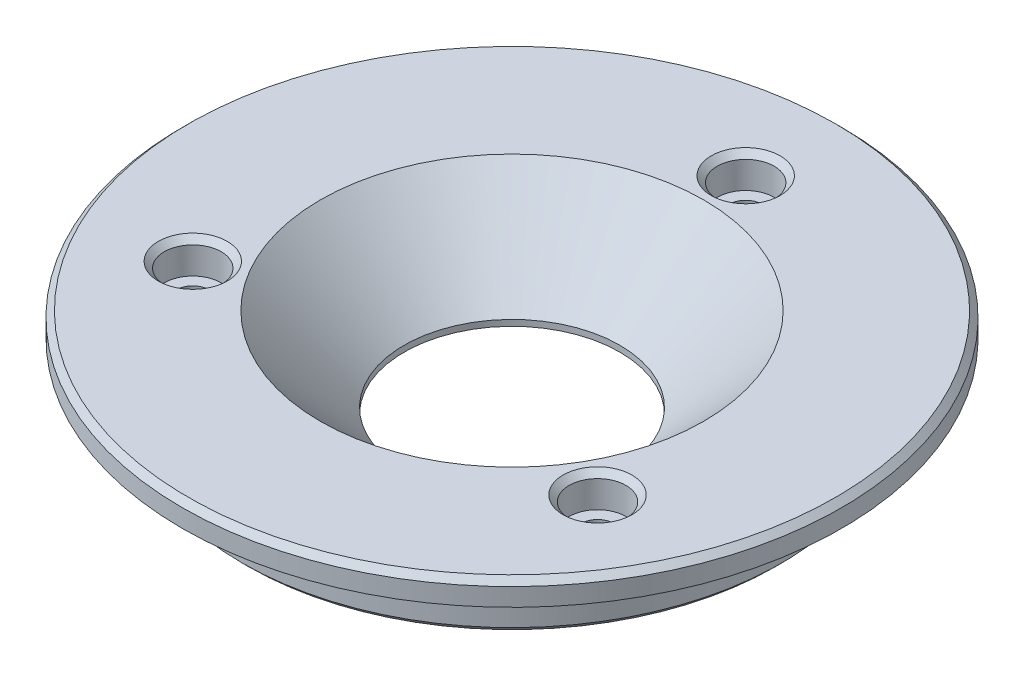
ISO-10303-21;
HEADER;
FILE_DESCRIPTION(('STEP AP214'),'2;1');
FILE_NAME('part.step','',(''),(''),'','','');
FILE_SCHEMA(('AUTOMOTIVE_DESIGN { 1 0 10303 214 1 1 1 1 }'));
ENDSEC;
DATA;
#1=APPLICATION_CONTEXT('core data for automotive mechanical design processes');
#2=APPLICATION_PROTOCOL_DEFINITION('international standard','automotive_design',2000,#1);
#3=PRODUCT_CONTEXT('',#1,'mechanical');
#4=PRODUCT('Part','Part','',(#3));
#5=PRODUCT_RELATED_PRODUCT_CATEGORY('part','',(#4));
#6=PRODUCT_DEFINITION_FORMATION('','',#4);
#7=PRODUCT_DEFINITION_CONTEXT('part definition',#1,'design');
#8=PRODUCT_DEFINITION('design','',#6,#7);
#9=PRODUCT_DEFINITION_SHAPE('','',#8);
#10=(LENGTH_UNIT() NAMED_UNIT(*) SI_UNIT(.MILLI.,.METRE.));
#11=(NAMED_UNIT(*) PLANE_ANGLE_UNIT() SI_UNIT($,.RADIAN.));
#12=(NAMED_UNIT(*) SI_UNIT($,.STERADIAN.) SOLID_ANGLE_UNIT());
#13=UNCERTAINTY_MEASURE_WITH_UNIT(LENGTH_MEASURE(1.E-05),#10,'distance_accuracy_value','');
#14=(GEOMETRIC_REPRESENTATION_CONTEXT(3) GLOBAL_UNCERTAINTY_ASSIGNED_CONTEXT((#13)) GLOBAL_UNIT_ASSIGNED_CONTEXT((#10,
#11,#12)) REPRESENTATION_CONTEXT('',''));
#15=CARTESIAN_POINT('',(0.,0.,0.));
#16=DIRECTION('',(0.,0.,1.));
#17=DIRECTION('',(1.,0.,0.));
#18=AXIS2_PLACEMENT_3D('',#15,#16,#17);
#19=CARTESIAN_POINT('',(-32.,15.,0.));
#20=DIRECTION('',(0.,-1.,0.));
#21=DIRECTION('',(0.,0.,-1.));
#22=AXIS2_PLACEMENT_3D('',#19,#20,#21);
#23=PLANE('',#22);
#24=CARTESIAN_POINT('',(33.7749907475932,15.,19.5));
#25=DIRECTION('',(0.,-1.,0.));
#26=DIRECTION('',(0.,0.,-1.));
#27=AXIS2_PLACEMENT_3D('',#24,#25,#26);
#28=CIRCLE('',#27,5.75);
#29=CARTESIAN_POINT('',(33.7749907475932,15.,13.75));
#30=VERTEX_POINT('',#29);
#31=EDGE_CURVE('E25',#30,#30,#28,.T.);
#32=ORIENTED_EDGE('',*,*,#31,.T.);
#33=EDGE_LOOP('',(#32));
#34=FACE_BOUND('',#33,.T.);
#35=CARTESIAN_POINT('',(0.,15.,-39.));
#36=DIRECTION('',(0.,-1.,0.));
#37=DIRECTION('',(0.,0.,-1.));
#38=AXIS2_PLACEMENT_3D('',#35,#36,#37);
#39=CIRCLE('',#38,5.75);
#40=CARTESIAN_POINT('',(0.,15.,-44.75));
#41=VERTEX_POINT('',#40);
#42=EDGE_CURVE('E29',#41,#41,#39,.T.);
#43=ORIENTED_EDGE('',*,*,#42,.T.);
#44=EDGE_LOOP('',(#43));
#45=FACE_BOUND('',#44,.T.);
#46=CARTESIAN_POINT('',(-33.7749907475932,15.,19.5));
#47=DIRECTION('',(0.,-1.,0.));
#48=DIRECTION('',(0.,0.,-1.));
#49=AXIS2_PLACEMENT_3D('',#46,#47,#48);
#50=CIRCLE('',#49,5.75);
#51=CARTESIAN_POINT('',(-33.7749907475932,15.,13.75));
#52=VERTEX_POINT('',#51);
#53=EDGE_CURVE('E34',#52,#52,#50,.T.);
#54=ORIENTED_EDGE('',*,*,#53,.T.);
#55=EDGE_LOOP('',(#54));
#56=FACE_BOUND('',#55,.T.);
#57=CARTESIAN_POINT('',(0.,15.,0.));
#58=DIRECTION('',(0.,-1.,0.));
#59=DIRECTION('',(0.,0.,-1.));
#60=AXIS2_PLACEMENT_3D('',#57,#58,#59);
#61=CIRCLE('',#60,54.);
#62=CARTESIAN_POINT('',(0.,15.,-54.));
#63=VERTEX_POINT('',#62);
#64=EDGE_CURVE('E58',#63,#63,#61,.F.);
#65=ORIENTED_EDGE('',*,*,#64,.T.);
#66=EDGE_LOOP('',(#65));
#67=FACE_BOUND('',#66,.T.);
#68=CARTESIAN_POINT('',(0.,15.,0.));
#69=DIRECTION('',(0.,-1.,0.));
#70=DIRECTION('',(0.,0.,-1.));
#71=AXIS2_PLACEMENT_3D('',#68,#69,#70);
#72=CIRCLE('',#71,32.);
#73=CARTESIAN_POINT('',(0.,15.,-32.));
#74=VERTEX_POINT('',#73);
#75=EDGE_CURVE('E70',#74,#74,#72,.T.);
#76=ORIENTED_EDGE('',*,*,#75,.T.);
#77=EDGE_LOOP('',(#76));
#78=FACE_BOUND('',#77,.T.);
#79=ADVANCED_FACE('F14',(#34,#45,#56,#67,#78),#23,.F.);
#80=CARTESIAN_POINT('',(0.,1.,0.));
#81=DIRECTION('',(0.,1.,0.));
#82=DIRECTION('',(0.,0.,1.));
#83=AXIS2_PLACEMENT_3D('',#80,#81,#82);
#84=CONICAL_SURFACE('',#83,18.,0.78539816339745);
#85=ORIENTED_EDGE('',*,*,#75,.F.);
#86=EDGE_LOOP('',(#85));
#87=FACE_BOUND('',#86,.T.);
#88=CARTESIAN_POINT('',(0.,1.,0.));
#89=DIRECTION('',(0.,-1.,0.));
#90=DIRECTION('',(0.,0.,-1.));
#91=AXIS2_PLACEMENT_3D('',#88,#89,#90);
#92=CIRCLE('',#91,18.);
#93=CARTESIAN_POINT('',(0.,1.,-18.));
#94=VERTEX_POINT('',#93);
#95=EDGE_CURVE('E83',#94,#94,#92,.T.);
#96=ORIENTED_EDGE('',*,*,#95,.T.);
#97=EDGE_LOOP('',(#96));
#98=FACE_BOUND('',#97,.T.);
#99=ADVANCED_FACE('F123',(#87,#98),#84,.F.);
#100=CARTESIAN_POINT('',(0.,0.,0.));
#101=DIRECTION('',(0.,-1.,0.));
#102=DIRECTION('',(0.,0.,-1.));
#103=AXIS2_PLACEMENT_3D('',#100,#101,#102);
#104=CYLINDRICAL_SURFACE('',#103,18.);
#105=ORIENTED_EDGE('',*,*,#95,.F.);
#106=EDGE_LOOP('',(#105));
#107=FACE_BOUND('',#106,.T.);
#108=CARTESIAN_POINT('',(0.,0.,0.));
#109=DIRECTION('',(0.,-1.,0.));
#110=DIRECTION('',(0.,0.,-1.));
#111=AXIS2_PLACEMENT_3D('',#108,#109,#110);
#112=CIRCLE('',#111,18.);
#113=CARTESIAN_POINT('',(0.,0.,-18.));
#114=VERTEX_POINT('',#113);
#115=EDGE_CURVE('E86',#114,#114,#112,.T.);
#116=ORIENTED_EDGE('',*,*,#115,.T.);
#117=EDGE_LOOP('',(#116));
#118=FACE_BOUND('',#117,.T.);
#119=ADVANCED_FACE('F130',(#107,#118),#104,.F.);
#120=CARTESIAN_POINT('',(-18.,0.,0.));
#121=DIRECTION('',(0.,1.,0.));
#122=DIRECTION('',(0.,0.,1.));
#123=AXIS2_PLACEMENT_3D('',#120,#121,#122);
#124=PLANE('',#123);
#125=CARTESIAN_POINT('',(-33.7749907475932,0.,19.5));
#126=DIRECTION('',(0.,1.,0.));
#127=DIRECTION('',(0.,0.,1.));
#128=AXIS2_PLACEMENT_3D('',#125,#126,#127);
#129=CIRCLE('',#128,3.7499999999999);
#130=CARTESIAN_POINT('',(-33.7749907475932,0.,23.2499999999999));
#131=VERTEX_POINT('',#130);
#132=EDGE_CURVE('E49',#131,#131,#129,.T.);
#133=ORIENTED_EDGE('',*,*,#132,.T.);
#134=EDGE_LOOP('',(#133));
#135=FACE_BOUND('',#134,.T.);
#136=CARTESIAN_POINT('',(33.7749907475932,0.,19.5));
#137=DIRECTION('',(0.,1.,0.));
#138=DIRECTION('',(0.,0.,1.));
#139=AXIS2_PLACEMENT_3D('',#136,#137,#138);
#140=CIRCLE('',#139,3.74999999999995);
#141=CARTESIAN_POINT('',(33.7749907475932,0.,23.25));
#142=VERTEX_POINT('',#141);
#143=EDGE_CURVE('E52',#142,#142,#140,.T.);
#144=ORIENTED_EDGE('',*,*,#143,.T.);
#145=EDGE_LOOP('',(#144));
#146=FACE_BOUND('',#145,.T.);
#147=CARTESIAN_POINT('',(0.,0.,-39.));
#148=DIRECTION('',(0.,1.,0.));
#149=DIRECTION('',(0.,0.,1.));
#150=AXIS2_PLACEMENT_3D('',#147,#148,#149);
#151=CIRCLE('',#150,3.74999999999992);
#152=CARTESIAN_POINT('',(0.,0.,-35.2500000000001));
#153=VERTEX_POINT('',#152);
#154=EDGE_CURVE('E55',#153,#153,#151,.T.);
#155=ORIENTED_EDGE('',*,*,#154,.T.);
#156=EDGE_LOOP('',(#155));
#157=FACE_BOUND('',#156,.T.);
#158=CARTESIAN_POINT('',(0.,0.,0.));
#159=DIRECTION('',(0.,1.,0.));
#160=DIRECTION('',(0.,0.,1.));
#161=AXIS2_PLACEMENT_3D('',#158,#159,#160);
#162=CIRCLE('',#161,44.);
#163=CARTESIAN_POINT('',(0.,0.,44.));
#164=VERTEX_POINT('',#163);
#165=EDGE_CURVE('E67',#164,#164,#162,.F.);
#166=ORIENTED_EDGE('',*,*,#165,.T.);
#167=EDGE_LOOP('',(#166));
#168=FACE_BOUND('',#167,.T.);
#169=ORIENTED_EDGE('',*,*,#115,.F.);
#170=EDGE_LOOP('',(#169));
#171=FACE_BOUND('',#170,.T.);
#172=ADVANCED_FACE('F181',(#135,#146,#157,#168,#171),#124,.F.);
#173=CARTESIAN_POINT('',(0.,0.,0.));
#174=DIRECTION('',(0.,-1.,0.));
#175=DIRECTION('',(0.,0.,-1.));
#176=AXIS2_PLACEMENT_3D('',#173,#174,#175);
#177=CYLINDRICAL_SURFACE('',#176,45.);
#178=CARTESIAN_POINT('',(0.,0.999999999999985,0.));
#179=DIRECTION('',(0.,1.,0.));
#180=DIRECTION('',(0.,0.,1.));
#181=AXIS2_PLACEMENT_3D('',#178,#179,#180);
#182=CIRCLE('',#181,45.);
#183=CARTESIAN_POINT('',(0.,0.999999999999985,45.));
#184=VERTEX_POINT('',#183);
#185=EDGE_CURVE('E64',#184,#184,#182,.T.);
#186=ORIENTED_EDGE('',*,*,#185,.T.);
#187=EDGE_LOOP('',(#186));
#188=FACE_BOUND('',#187,.T.);
#189=CARTESIAN_POINT('',(0.,11.,0.));
#190=DIRECTION('',(0.,-1.,0.));
#191=DIRECTION('',(0.,0.,-1.));
#192=AXIS2_PLACEMENT_3D('',#189,#190,#191);
#193=CIRCLE('',#192,45.);
#194=CARTESIAN_POINT('',(0.,11.,-45.));
#195=VERTEX_POINT('',#194);
#196=EDGE_CURVE('E89',#195,#195,#193,.T.);
#197=ORIENTED_EDGE('',*,*,#196,.T.);
#198=EDGE_LOOP('',(#197));
#199=FACE_BOUND('',#198,.T.);
#200=ADVANCED_FACE('F185',(#188,#199),#177,.T.);
#201=CARTESIAN_POINT('',(-45.,11.,0.));
#202=DIRECTION('',(0.,1.,0.));
#203=DIRECTION('',(0.,0.,1.));
#204=AXIS2_PLACEMENT_3D('',#201,#202,#203);
#205=PLANE('',#204);
#206=ORIENTED_EDGE('',*,*,#196,.F.);
#207=EDGE_LOOP('',(#206));
#208=FACE_BOUND('',#207,.T.);
#209=CARTESIAN_POINT('',(0.,11.,0.));
#210=DIRECTION('',(0.,-1.,0.));
#211=DIRECTION('',(0.,0.,-1.));
#212=AXIS2_PLACEMENT_3D('',#209,#210,#211);
#213=CIRCLE('',#212,55.);
#214=CARTESIAN_POINT('',(0.,11.,-55.));
#215=VERTEX_POINT('',#214);
#216=EDGE_CURVE('E92',#215,#215,#213,.T.);
#217=ORIENTED_EDGE('',*,*,#216,.T.);
#218=EDGE_LOOP('',(#217));
#219=FACE_BOUND('',#218,.T.);
#220=ADVANCED_FACE('F192',(#208,#219),#205,.F.);
#221=CARTESIAN_POINT('',(0.,0.,0.));
#222=DIRECTION('',(0.,-1.,0.));
#223=DIRECTION('',(0.,0.,-1.));
#224=AXIS2_PLACEMENT_3D('',#221,#222,#223);
#225=CYLINDRICAL_SURFACE('',#224,55.);
#226=CARTESIAN_POINT('',(0.,14.,0.));
#227=DIRECTION('',(0.,-1.,0.));
#228=DIRECTION('',(0.,0.,-1.));
#229=AXIS2_PLACEMENT_3D('',#226,#227,#228);
#230=CIRCLE('',#229,55.);
#231=CARTESIAN_POINT('',(0.,14.,-55.));
#232=VERTEX_POINT('',#231);
#233=EDGE_CURVE('E61',#232,#232,#230,.T.);
#234=ORIENTED_EDGE('',*,*,#233,.T.);
#235=EDGE_LOOP('',(#234));
#236=FACE_BOUND('',#235,.T.);
#237=ORIENTED_EDGE('',*,*,#216,.F.);
#238=EDGE_LOOP('',(#237));
#239=FACE_BOUND('',#238,.T.);
#240=ADVANCED_FACE('F199',(#236,#239),#225,.T.);
#241=CARTESIAN_POINT('',(33.7749907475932,9.5,19.5));
#242=DIRECTION('',(0.,1.,0.));
#243=DIRECTION('',(0.,0.,1.));
#244=AXIS2_PLACEMENT_3D('',#241,#242,#243);
#245=CYLINDRICAL_SURFACE('',#244,4.75);
#246=CARTESIAN_POINT('',(33.7749907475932,14.,19.5));
#247=DIRECTION('',(0.,-1.,0.));
#248=DIRECTION('',(0.,0.,-1.));
#249=AXIS2_PLACEMENT_3D('',#246,#247,#248);
#250=CIRCLE('',#249,4.75);
#251=CARTESIAN_POINT('',(33.7749907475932,14.,14.75));
#252=VERTEX_POINT('',#251);
#253=EDGE_CURVE('E37',#252,#252,#250,.F.);
#254=ORIENTED_EDGE('',*,*,#253,.T.);
#255=EDGE_LOOP('',(#254));
#256=FACE_BOUND('',#255,.T.);
#257=CARTESIAN_POINT('',(33.7749907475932,9.5,19.5));
#258=DIRECTION('',(0.,1.,0.));
#259=DIRECTION('',(0.,0.,-1.));
#260=AXIS2_PLACEMENT_3D('',#257,#258,#259);
#261=CIRCLE('',#260,4.75);
#262=CARTESIAN_POINT('',(33.7749907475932,9.5,14.75));
#263=VERTEX_POINT('',#262);
#264=EDGE_CURVE('E74',#263,#263,#261,.T.);
#265=ORIENTED_EDGE('',*,*,#264,.F.);
#266=EDGE_LOOP('',(#265));
#267=FACE_BOUND('',#266,.T.);
#268=ADVANCED_FACE('F203',(#256,#267),#245,.F.);
#269=CARTESIAN_POINT('',(33.7749907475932,9.5,19.5));
#270=DIRECTION('',(0.,-1.,0.));
#271=DIRECTION('',(0.,0.,-1.));
#272=AXIS2_PLACEMENT_3D('',#269,#270,#271);
#273=PLANE('',#272);
#274=CARTESIAN_POINT('',(33.7749907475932,9.5,19.5));
#275=DIRECTION('',(0.,-1.,0.));
#276=DIRECTION('',(0.,0.,-1.));
#277=AXIS2_PLACEMENT_3D('',#274,#275,#276);
#278=CIRCLE('',#277,2.75);
#279=CARTESIAN_POINT('',(33.7749907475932,9.5,16.75));
#280=VERTEX_POINT('',#279);
#281=EDGE_CURVE('E71',#280,#280,#278,.T.);
#282=ORIENTED_EDGE('',*,*,#281,.T.);
#283=EDGE_LOOP('',(#282));
#284=FACE_BOUND('',#283,.T.);
#285=ORIENTED_EDGE('',*,*,#264,.T.);
#286=EDGE_LOOP('',(#285));
#287=FACE_BOUND('',#286,.T.);
#288=ADVANCED_FACE('F207',(#284,#287),#273,.F.);
#289=CARTESIAN_POINT('',(-33.7749907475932,9.5,19.5));
#290=DIRECTION('',(0.,1.,0.));
#291=DIRECTION('',(0.,0.,1.));
#292=AXIS2_PLACEMENT_3D('',#289,#290,#291);
#293=CYLINDRICAL_SURFACE('',#292,4.75);
#294=CARTESIAN_POINT('',(-33.7749907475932,14.,19.5));
#295=DIRECTION('',(0.,-1.,0.));
#296=DIRECTION('',(0.,0.,-1.));
#297=AXIS2_PLACEMENT_3D('',#294,#295,#296);
#298=CIRCLE('',#297,4.75);
#299=CARTESIAN_POINT('',(-33.7749907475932,14.,14.75));
#300=VERTEX_POINT('',#299);
#301=EDGE_CURVE('E9',#300,#300,#298,.F.);
#302=ORIENTED_EDGE('',*,*,#301,.T.);
#303=EDGE_LOOP('',(#302));
#304=FACE_BOUND('',#303,.T.);
#305=CARTESIAN_POINT('',(-33.7749907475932,9.5,19.5));
#306=DIRECTION('',(0.,1.,0.));
#307=DIRECTION('',(0.,0.,1.));
#308=AXIS2_PLACEMENT_3D('',#305,#306,#307);
#309=CIRCLE('',#308,4.75);
#310=CARTESIAN_POINT('',(-33.7749907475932,9.5,24.25));
#311=VERTEX_POINT('',#310);
#312=EDGE_CURVE('E98',#311,#311,#309,.T.);
#313=ORIENTED_EDGE('',*,*,#312,.F.);
#314=EDGE_LOOP('',(#313));
#315=FACE_BOUND('',#314,.T.);
#316=ADVANCED_FACE('F119',(#304,#315),#293,.F.);
#317=CARTESIAN_POINT('',(-33.7749907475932,9.5,19.5));
#318=DIRECTION('',(0.,1.,0.));
#319=DIRECTION('',(0.,0.,1.));
#320=AXIS2_PLACEMENT_3D('',#317,#318,#319);
#321=PLANE('',#320);
#322=CARTESIAN_POINT('',(-33.7749907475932,9.5,19.5));
#323=DIRECTION('',(0.,1.,0.));
#324=DIRECTION('',(0.,0.,1.));
#325=AXIS2_PLACEMENT_3D('',#322,#323,#324);
#326=CIRCLE('',#325,2.75);
#327=CARTESIAN_POINT('',(-33.7749907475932,9.5,22.25));
#328=VERTEX_POINT('',#327);
#329=EDGE_CURVE('E75',#328,#328,#326,.T.);
#330=ORIENTED_EDGE('',*,*,#329,.F.);
#331=EDGE_LOOP('',(#330));
#332=FACE_BOUND('',#331,.T.);
#333=ORIENTED_EDGE('',*,*,#312,.T.);
#334=EDGE_LOOP('',(#333));
#335=FACE_BOUND('',#334,.T.);
#336=ADVANCED_FACE('F108',(#332,#335),#321,.T.);
#337=CARTESIAN_POINT('',(0.,9.5,-39.));
#338=DIRECTION('',(0.,1.,0.));
#339=DIRECTION('',(0.,0.,1.));
#340=AXIS2_PLACEMENT_3D('',#337,#338,#339);
#341=CYLINDRICAL_SURFACE('',#340,4.75);
#342=CARTESIAN_POINT('',(0.,14.,-39.));
#343=DIRECTION('',(0.,-1.,0.));
#344=DIRECTION('',(0.,0.,-1.));
#345=AXIS2_PLACEMENT_3D('',#342,#343,#344);
#346=CIRCLE('',#345,4.75);
#347=CARTESIAN_POINT('',(0.,14.,-43.75));
#348=VERTEX_POINT('',#347);
#349=EDGE_CURVE('E21',#348,#348,#346,.F.);
#350=ORIENTED_EDGE('',*,*,#349,.T.);
#351=EDGE_LOOP('',(#350));
#352=FACE_BOUND('',#351,.T.);
#353=CARTESIAN_POINT('',(0.,9.5,-39.));
#354=DIRECTION('',(0.,1.,0.));
#355=DIRECTION('',(0.,0.,1.));
#356=AXIS2_PLACEMENT_3D('',#353,#354,#355);
#357=CIRCLE('',#356,4.75);
#358=CARTESIAN_POINT('',(0.,9.5,-34.25));
#359=VERTEX_POINT('',#358);
#360=EDGE_CURVE('E95',#359,#359,#357,.T.);
#361=ORIENTED_EDGE('',*,*,#360,.F.);
#362=EDGE_LOOP('',(#361));
#363=FACE_BOUND('',#362,.T.);
#364=ADVANCED_FACE('F106',(#352,#363),#341,.F.);
#365=CARTESIAN_POINT('',(0.,9.5,-39.));
#366=DIRECTION('',(0.,1.,0.));
#367=DIRECTION('',(0.,0.,1.));
#368=AXIS2_PLACEMENT_3D('',#365,#366,#367);
#369=PLANE('',#368);
#370=CARTESIAN_POINT('',(0.,9.5,-39.));
#371=DIRECTION('',(0.,1.,0.));
#372=DIRECTION('',(0.,0.,1.));
#373=AXIS2_PLACEMENT_3D('',#370,#371,#372);
#374=CIRCLE('',#373,2.75);
#375=CARTESIAN_POINT('',(0.,9.5,-36.25));
#376=VERTEX_POINT('',#375);
#377=EDGE_CURVE('E78',#376,#376,#374,.T.);
#378=ORIENTED_EDGE('',*,*,#377,.F.);
#379=EDGE_LOOP('',(#378));
#380=FACE_BOUND('',#379,.T.);
#381=ORIENTED_EDGE('',*,*,#360,.T.);
#382=EDGE_LOOP('',(#381));
#383=FACE_BOUND('',#382,.T.);
#384=ADVANCED_FACE('F104',(#380,#383),#369,.T.);
#385=CARTESIAN_POINT('',(0.,0.,-39.));
#386=DIRECTION('',(0.,1.,0.));
#387=DIRECTION('',(0.,0.,1.));
#388=AXIS2_PLACEMENT_3D('',#385,#386,#387);
#389=CYLINDRICAL_SURFACE('',#388,2.75);
#390=CARTESIAN_POINT('',(0.,0.999999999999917,-39.));
#391=DIRECTION('',(0.,1.,0.));
#392=DIRECTION('',(0.,0.,1.));
#393=AXIS2_PLACEMENT_3D('',#390,#391,#392);
#394=CIRCLE('',#393,2.75);
#395=CARTESIAN_POINT('',(0.,0.999999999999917,-36.25));
#396=VERTEX_POINT('',#395);
#397=EDGE_CURVE('E40',#396,#396,#394,.F.);
#398=ORIENTED_EDGE('',*,*,#397,.T.);
#399=EDGE_LOOP('',(#398));
#400=FACE_BOUND('',#399,.T.);
#401=ORIENTED_EDGE('',*,*,#377,.T.);
#402=EDGE_LOOP('',(#401));
#403=FACE_BOUND('',#402,.T.);
#404=ADVANCED_FACE('F116',(#400,#403),#389,.F.);
#405=CARTESIAN_POINT('',(-33.7749907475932,0.,19.5));
#406=DIRECTION('',(0.,1.,0.));
#407=DIRECTION('',(0.,0.,1.));
#408=AXIS2_PLACEMENT_3D('',#405,#406,#407);
#409=CYLINDRICAL_SURFACE('',#408,2.75);
#410=CARTESIAN_POINT('',(-33.7749907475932,0.999999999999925,19.5));
#411=DIRECTION('',(0.,1.,0.));
#412=DIRECTION('',(0.,0.,1.));
#413=AXIS2_PLACEMENT_3D('',#410,#411,#412);
#414=CIRCLE('',#413,2.75);
#415=CARTESIAN_POINT('',(-33.7749907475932,0.999999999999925,22.25));
#416=VERTEX_POINT('',#415);
#417=EDGE_CURVE('E46',#416,#416,#414,.F.);
#418=ORIENTED_EDGE('',*,*,#417,.T.);
#419=EDGE_LOOP('',(#418));
#420=FACE_BOUND('',#419,.T.);
#421=ORIENTED_EDGE('',*,*,#329,.T.);
#422=EDGE_LOOP('',(#421));
#423=FACE_BOUND('',#422,.T.);
#424=ADVANCED_FACE('F338',(#420,#423),#409,.F.);
#425=CARTESIAN_POINT('',(33.7749907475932,0.,19.5));
#426=DIRECTION('',(0.,1.,0.));
#427=DIRECTION('',(0.,0.,1.));
#428=AXIS2_PLACEMENT_3D('',#425,#426,#427);
#429=CYLINDRICAL_SURFACE('',#428,2.75);
#430=CARTESIAN_POINT('',(33.7749907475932,0.999999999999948,19.5));
#431=DIRECTION('',(0.,1.,0.));
#432=DIRECTION('',(0.,0.,1.));
#433=AXIS2_PLACEMENT_3D('',#430,#431,#432);
#434=CIRCLE('',#433,2.75);
#435=CARTESIAN_POINT('',(33.7749907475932,0.999999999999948,22.25));
#436=VERTEX_POINT('',#435);
#437=EDGE_CURVE('E43',#436,#436,#434,.F.);
#438=ORIENTED_EDGE('',*,*,#437,.T.);
#439=EDGE_LOOP('',(#438));
#440=FACE_BOUND('',#439,.T.);
#441=ORIENTED_EDGE('',*,*,#281,.F.);
#442=EDGE_LOOP('',(#441));
#443=FACE_BOUND('',#442,.T.);
#444=ADVANCED_FACE('F140',(#440,#443),#429,.F.);
#445=CARTESIAN_POINT('',(0.,0.,0.));
#446=DIRECTION('',(0.,1.,0.));
#447=DIRECTION('',(0.,0.,1.));
#448=AXIS2_PLACEMENT_3D('',#445,#446,#447);
#449=CONICAL_SURFACE('',#448,44.,0.785398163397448);
#450=ORIENTED_EDGE('',*,*,#185,.F.);
#451=EDGE_LOOP('',(#450));
#452=FACE_BOUND('',#451,.T.);
#453=ORIENTED_EDGE('',*,*,#165,.F.);
#454=EDGE_LOOP('',(#453));
#455=FACE_BOUND('',#454,.T.);
#456=ADVANCED_FACE('F136',(#452,#455),#449,.T.);
#457=CARTESIAN_POINT('',(0.,14.,0.));
#458=DIRECTION('',(0.,-1.,0.));
#459=DIRECTION('',(0.,0.,-1.));
#460=AXIS2_PLACEMENT_3D('',#457,#458,#459);
#461=CONICAL_SURFACE('',#460,55.,0.785398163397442);
#462=ORIENTED_EDGE('',*,*,#64,.F.);
#463=EDGE_LOOP('',(#462));
#464=FACE_BOUND('',#463,.T.);
#465=ORIENTED_EDGE('',*,*,#233,.F.);
#466=EDGE_LOOP('',(#465));
#467=FACE_BOUND('',#466,.T.);
#468=ADVANCED_FACE('F139',(#464,#467),#461,.T.);
#469=CARTESIAN_POINT('',(-33.7749907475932,0.,19.5));
#470=DIRECTION('',(0.,-1.,0.));
#471=DIRECTION('',(0.,0.,-1.));
#472=AXIS2_PLACEMENT_3D('',#469,#470,#471);
#473=CONICAL_SURFACE('',#472,3.7499999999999,0.785398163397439);
#474=ORIENTED_EDGE('',*,*,#417,.F.);
#475=EDGE_LOOP('',(#474));
#476=FACE_BOUND('',#475,.T.);
#477=ORIENTED_EDGE('',*,*,#132,.F.);
#478=EDGE_LOOP('',(#477));
#479=FACE_BOUND('',#478,.T.);
#480=ADVANCED_FACE('F144',(#476,#479),#473,.F.);
#481=CARTESIAN_POINT('',(33.7749907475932,0.,19.5));
#482=DIRECTION('',(0.,-1.,0.));
#483=DIRECTION('',(0.,0.,-1.));
#484=AXIS2_PLACEMENT_3D('',#481,#482,#483);
#485=CONICAL_SURFACE('',#484,3.74999999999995,0.785398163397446);
#486=ORIENTED_EDGE('',*,*,#437,.F.);
#487=EDGE_LOOP('',(#486));
#488=FACE_BOUND('',#487,.T.);
#489=ORIENTED_EDGE('',*,*,#143,.F.);
#490=EDGE_LOOP('',(#489));
#491=FACE_BOUND('',#490,.T.);
#492=ADVANCED_FACE('F148',(#488,#491),#485,.F.);
#493=CARTESIAN_POINT('',(0.,0.,-39.));
#494=DIRECTION('',(0.,-1.,0.));
#495=DIRECTION('',(0.,0.,-1.));
#496=AXIS2_PLACEMENT_3D('',#493,#494,#495);
#497=CONICAL_SURFACE('',#496,3.74999999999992,0.785398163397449);
#498=ORIENTED_EDGE('',*,*,#397,.F.);
#499=EDGE_LOOP('',(#498));
#500=FACE_BOUND('',#499,.T.);
#501=ORIENTED_EDGE('',*,*,#154,.F.);
#502=EDGE_LOOP('',(#501));
#503=FACE_BOUND('',#502,.T.);
#504=ADVANCED_FACE('F152',(#500,#503),#497,.F.);
#505=CARTESIAN_POINT('',(33.7749907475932,14.,19.5));
#506=DIRECTION('',(0.,1.,0.));
#507=DIRECTION('',(0.,0.,1.));
#508=AXIS2_PLACEMENT_3D('',#505,#506,#507);
#509=CONICAL_SURFACE('',#508,4.75,0.785398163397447);
#510=ORIENTED_EDGE('',*,*,#31,.F.);
#511=EDGE_LOOP('',(#510));
#512=FACE_BOUND('',#511,.T.);
#513=ORIENTED_EDGE('',*,*,#253,.F.);
#514=EDGE_LOOP('',(#513));
#515=FACE_BOUND('',#514,.T.);
#516=ADVANCED_FACE('F156',(#512,#515),#509,.F.);
#517=CARTESIAN_POINT('',(0.,14.,-39.));
#518=DIRECTION('',(0.,1.,0.));
#519=DIRECTION('',(0.,0.,1.));
#520=AXIS2_PLACEMENT_3D('',#517,#518,#519);
#521=CONICAL_SURFACE('',#520,4.75,0.785398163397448);
#522=ORIENTED_EDGE('',*,*,#42,.F.);
#523=EDGE_LOOP('',(#522));
#524=FACE_BOUND('',#523,.T.);
#525=ORIENTED_EDGE('',*,*,#349,.F.);
#526=EDGE_LOOP('',(#525));
#527=FACE_BOUND('',#526,.T.);
#528=ADVANCED_FACE('F159',(#524,#527),#521,.F.);
#529=CARTESIAN_POINT('',(-33.7749907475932,14.,19.5));
#530=DIRECTION('',(0.,1.,0.));
#531=DIRECTION('',(0.,0.,1.));
#532=AXIS2_PLACEMENT_3D('',#529,#530,#531);
#533=CONICAL_SURFACE('',#532,4.75,0.785398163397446);
#534=ORIENTED_EDGE('',*,*,#53,.F.);
#535=EDGE_LOOP('',(#534));
#536=FACE_BOUND('',#535,.T.);
#537=ORIENTED_EDGE('',*,*,#301,.F.);
#538=EDGE_LOOP('',(#537));
#539=FACE_BOUND('',#538,.T.);
#540=ADVANCED_FACE('F16',(#536,#539),#533,.F.);
#541=CLOSED_SHELL('',(#79,#99,#119,#172,#200,#220,#240,#268,#288,#316,#336,#364,#384,#404,#424,
#444,#456,#468,#480,#492,#504,#516,#528,#540));
#542=MANIFOLD_SOLID_BREP('B1',#541);
#543=ADVANCED_BREP_SHAPE_REPRESENTATION('',(#18,#542),#14);
#544=SHAPE_DEFINITION_REPRESENTATION(#9,#543);
ENDSEC;
END-ISO-10303-21;
